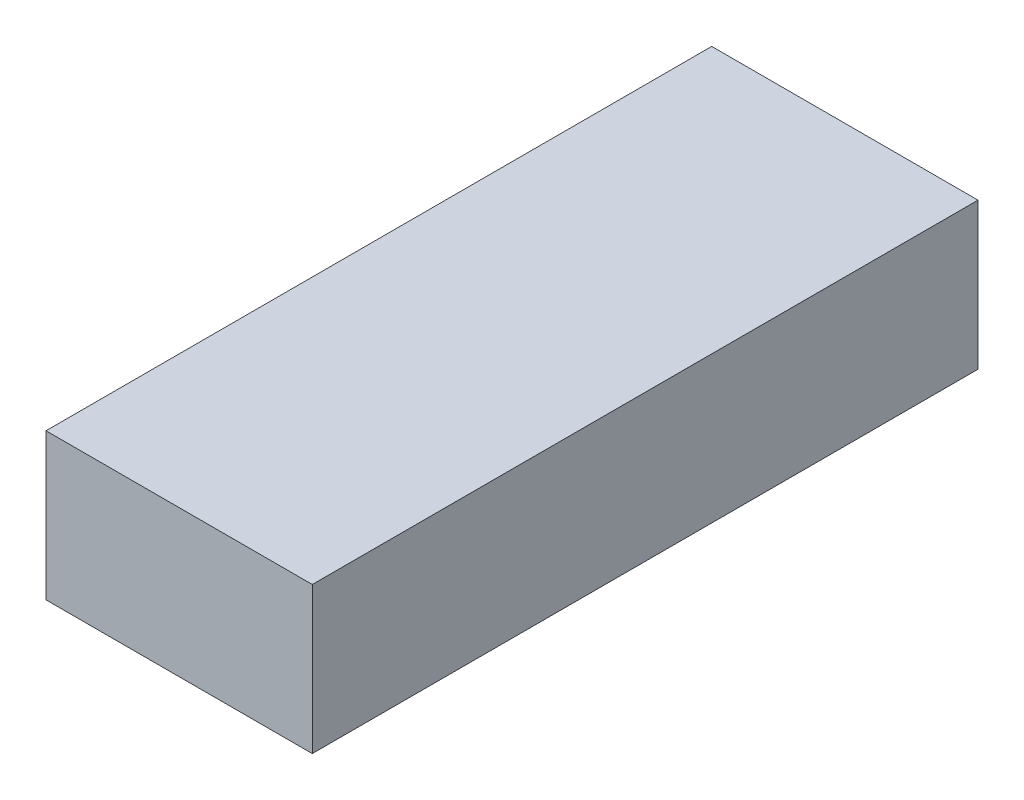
from build123d import *

# Parameters (mm, degrees)
SKETCH1_W           = 20
SKETCH1_H           = 11
BOSS_EXTRUDE1_DEPTH = 50


with BuildPart() as part:
    # Sketch1 → Boss-Extrude1 (new body)
    with BuildSketch(Plane.XY):
        with Locations((10, 5.5)):
            Rectangle(SKETCH1_W, SKETCH1_H)
    extrude(amount=BOSS_EXTRUDE1_DEPTH)


solid = part.part
